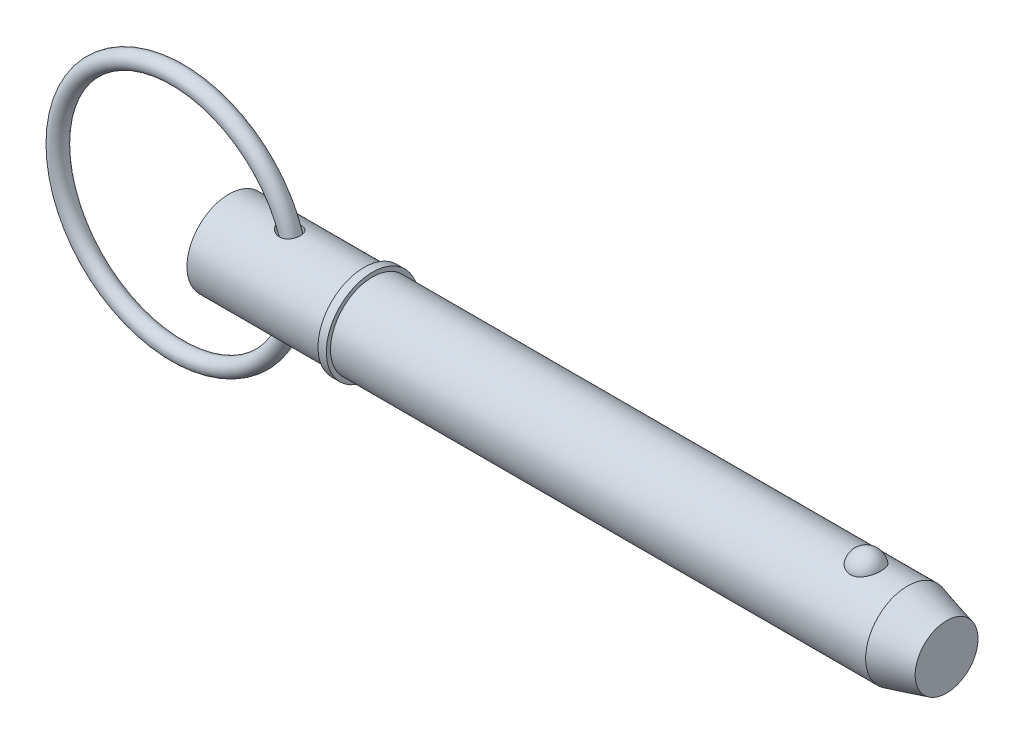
ISO-10303-21;
HEADER;
FILE_DESCRIPTION(('STEP AP214'),'2;1');
FILE_NAME('part.step','',(''),(''),'','','');
FILE_SCHEMA(('AUTOMOTIVE_DESIGN { 1 0 10303 214 1 1 1 1 }'));
ENDSEC;
DATA;
#1=APPLICATION_CONTEXT('core data for automotive mechanical design processes');
#2=APPLICATION_PROTOCOL_DEFINITION('international standard','automotive_design',2000,#1);
#3=PRODUCT_CONTEXT('',#1,'mechanical');
#4=PRODUCT('Part','Part','',(#3));
#5=PRODUCT_RELATED_PRODUCT_CATEGORY('part','',(#4));
#6=PRODUCT_DEFINITION_FORMATION('','',#4);
#7=PRODUCT_DEFINITION_CONTEXT('part definition',#1,'design');
#8=PRODUCT_DEFINITION('design','',#6,#7);
#9=PRODUCT_DEFINITION_SHAPE('','',#8);
#10=(LENGTH_UNIT() NAMED_UNIT(*) SI_UNIT(.MILLI.,.METRE.));
#11=(NAMED_UNIT(*) PLANE_ANGLE_UNIT() SI_UNIT($,.RADIAN.));
#12=(NAMED_UNIT(*) SI_UNIT($,.STERADIAN.) SOLID_ANGLE_UNIT());
#13=UNCERTAINTY_MEASURE_WITH_UNIT(LENGTH_MEASURE(1.E-05),#10,'distance_accuracy_value','');
#14=(GEOMETRIC_REPRESENTATION_CONTEXT(3) GLOBAL_UNCERTAINTY_ASSIGNED_CONTEXT((#13)) GLOBAL_UNIT_ASSIGNED_CONTEXT((#10,
#11,#12)) REPRESENTATION_CONTEXT('',''));
#15=CARTESIAN_POINT('',(0.,0.,0.));
#16=DIRECTION('',(0.,0.,1.));
#17=DIRECTION('',(1.,0.,0.));
#18=AXIS2_PLACEMENT_3D('',#15,#16,#17);
#19=CARTESIAN_POINT('',(-13.640845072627,0.,0.));
#20=DIRECTION('',(0.,0.,1.));
#21=DIRECTION('',(1.,0.,0.));
#22=AXIS2_PLACEMENT_3D('',#19,#20,#21);
#23=TOROIDAL_SURFACE('',#22,31.75,2.223);
#24=CARTESIAN_POINT('',(20.332154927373,0.,0.));
#25=VERTEX_POINT('',#24);
#26=VERTEX_LOOP('',#25);
#27=FACE_BOUND('',#26,.T.);
#28=ADVANCED_FACE('P0_F12',(#27),#23,.T.);
#29=CLOSED_SHELL('',(#28));
#30=MANIFOLD_SOLID_BREP('P0_B1',#29);
#31=CARTESIAN_POINT('',(0.,0.,0.));
#32=DIRECTION('',(1.,0.,0.));
#33=DIRECTION('',(0.,0.,-1.));
#34=AXIS2_PLACEMENT_3D('',#31,#32,#33);
#35=CYLINDRICAL_SURFACE('',#34,11.115);
#36=CARTESIAN_POINT('',(13.5245830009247,11.0328953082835,-1.34849772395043));
#37=CARTESIAN_POINT('',(13.6190616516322,11.0150940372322,-1.49413162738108));
#38=CARTESIAN_POINT('',(13.7272589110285,10.9954577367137,-1.63076546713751));
#39=CARTESIAN_POINT('',(13.9654537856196,10.9550099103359,-1.8834727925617));
#40=CARTESIAN_POINT('',(14.0954990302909,10.9341958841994,-1.99950019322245));
#41=CARTESIAN_POINT('',(14.3718600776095,10.893854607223,-2.20871939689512));
#42=CARTESIAN_POINT('',(14.5180879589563,10.8743212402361,-2.30202655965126));
#43=CARTESIAN_POINT('',(14.8233821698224,10.8385071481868,-2.46515115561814));
#44=CARTESIAN_POINT('',(14.9824448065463,10.8222254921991,-2.53497531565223));
#45=CARTESIAN_POINT('',(15.3233581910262,10.7936101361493,-2.65430007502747));
#46=CARTESIAN_POINT('',(15.5060064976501,10.7817126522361,-2.7016502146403));
#47=CARTESIAN_POINT('',(15.8771124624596,10.7657570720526,-2.76455948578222));
#48=CARTESIAN_POINT('',(16.0655695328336,10.7616981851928,-2.78012182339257));
#49=CARTESIAN_POINT('',(16.4345152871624,10.7624400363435,-2.77724928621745));
#50=CARTESIAN_POINT('',(16.6150121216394,10.7668823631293,-2.76018977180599));
#51=CARTESIAN_POINT('',(16.9695132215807,10.7837407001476,-2.69357457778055));
#52=CARTESIAN_POINT('',(17.1435222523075,10.7961507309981,-2.64404326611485));
#53=CARTESIAN_POINT('',(17.4621418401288,10.8258984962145,-2.51928348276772));
#54=CARTESIAN_POINT('',(17.6079677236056,10.8426430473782,-2.44700611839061));
#55=CARTESIAN_POINT('',(17.884162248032,10.8794194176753,-2.27791740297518));
#56=CARTESIAN_POINT('',(18.0145349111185,10.8994503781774,-2.18111245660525));
#57=CARTESIAN_POINT('',(18.2494965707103,10.9392822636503,-1.9713196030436));
#58=CARTESIAN_POINT('',(18.3550661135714,10.9590421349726,-1.85941863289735));
#59=CARTESIAN_POINT('',(18.5458147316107,10.9970986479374,-1.61919918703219));
#60=CARTESIAN_POINT('',(18.6309947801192,11.0153953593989,-1.49088149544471));
#61=CARTESIAN_POINT('',(18.7786686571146,11.0484675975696,-1.2218388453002));
#62=CARTESIAN_POINT('',(18.8412214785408,11.063252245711,-1.08114735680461));
#63=CARTESIAN_POINT('',(18.9425265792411,11.0877718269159,-0.791025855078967));
#64=CARTESIAN_POINT('',(18.9812780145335,11.0975065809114,-0.641595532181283));
#65=CARTESIAN_POINT('',(19.0343305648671,11.1109435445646,-0.336997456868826));
#66=CARTESIAN_POINT('',(19.0484404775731,11.1145985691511,-0.181794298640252));
#67=CARTESIAN_POINT('',(19.0513147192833,11.1153384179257,0.128864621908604));
#68=CARTESIAN_POINT('',(19.0400783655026,11.112423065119,0.284320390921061));
#69=CARTESIAN_POINT('',(18.9924362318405,11.1003163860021,0.591525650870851));
#70=CARTESIAN_POINT('',(18.9559600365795,11.0911075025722,0.743263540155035));
#71=CARTESIAN_POINT('',(18.858576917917,11.0673920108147,1.0382524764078));
#72=CARTESIAN_POINT('',(18.7976699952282,11.0528854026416,1.18150352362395));
#73=CARTESIAN_POINT('',(18.6529960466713,11.020201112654,1.45511394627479));
#74=CARTESIAN_POINT('',(18.5692772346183,11.0020311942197,1.58549973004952));
#75=CARTESIAN_POINT('',(18.3810003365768,10.9640237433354,1.82995492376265));
#76=CARTESIAN_POINT('',(18.2764441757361,10.9441863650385,1.94402583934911));
#77=CARTESIAN_POINT('',(18.0501398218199,10.9052267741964,2.15183128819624));
#78=CARTESIAN_POINT('',(17.9285270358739,10.8861003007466,2.24571250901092));
#79=CARTESIAN_POINT('',(17.6709592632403,10.8505244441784,2.41175942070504));
#80=CARTESIAN_POINT('',(17.5350055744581,10.8340748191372,2.48392707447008));
#81=CARTESIAN_POINT('',(17.2528390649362,10.8056099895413,2.60497667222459));
#82=CARTESIAN_POINT('',(17.1066353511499,10.7935909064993,2.65387899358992));
#83=CARTESIAN_POINT('',(16.8080326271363,10.7750969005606,2.72799859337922));
#84=CARTESIAN_POINT('',(16.6556326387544,10.7686228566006,2.75321211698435));
#85=CARTESIAN_POINT('',(16.3428877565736,10.761517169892,2.78086153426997));
#86=CARTESIAN_POINT('',(16.1824599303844,10.7611149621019,2.78240297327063));
#87=CARTESIAN_POINT('',(15.863296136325,10.766478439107,2.76156874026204));
#88=CARTESIAN_POINT('',(15.7045607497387,10.7722461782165,2.73918510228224));
#89=CARTESIAN_POINT('',(15.3787211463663,10.7898500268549,2.66904167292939));
#90=CARTESIAN_POINT('',(15.2120794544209,10.8021675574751,2.61925575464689));
#91=CARTESIAN_POINT('',(14.8886284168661,10.8315482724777,2.49496357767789));
#92=CARTESIAN_POINT('',(14.731827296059,10.8486153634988,2.42043695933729));
#93=CARTESIAN_POINT('',(14.4198762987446,10.8870804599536,2.24137362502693));
#94=CARTESIAN_POINT('',(14.2658484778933,10.9087148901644,2.13492229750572));
#95=CARTESIAN_POINT('',(13.9788214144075,10.9526299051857,1.89676517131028));
#96=CARTESIAN_POINT('',(13.8458041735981,10.9749099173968,1.76508120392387));
#97=CARTESIAN_POINT('',(13.6310853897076,11.012885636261,1.50762337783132));
#98=CARTESIAN_POINT('',(13.5444453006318,11.0290026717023,1.38602082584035));
#99=CARTESIAN_POINT('',(13.392158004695,11.0581740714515,1.12983363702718));
#100=CARTESIAN_POINT('',(13.3264946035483,11.0712307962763,0.995259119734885));
#101=CARTESIAN_POINT('',(13.2464179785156,11.0874250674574,0.785640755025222));
#102=CARTESIAN_POINT('',(13.2227369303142,11.0922707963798,0.714166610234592));
#103=CARTESIAN_POINT('',(13.1820656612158,11.1006486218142,0.569277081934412));
#104=CARTESIAN_POINT('',(13.1650721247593,11.1041813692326,0.495862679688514));
#105=CARTESIAN_POINT('',(13.1381118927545,11.1098070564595,0.347711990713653));
#106=CARTESIAN_POINT('',(13.1281436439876,11.1119003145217,0.272975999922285));
#107=CARTESIAN_POINT('',(13.1154243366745,11.1145746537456,0.122890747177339));
#108=CARTESIAN_POINT('',(13.1126723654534,11.1151559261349,0.0475415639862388));
#109=CARTESIAN_POINT('',(13.115160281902,11.1146296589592,-0.160384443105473));
#110=CARTESIAN_POINT('',(13.128061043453,11.111903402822,-0.292944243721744));
#111=CARTESIAN_POINT('',(13.175691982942,11.1019662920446,-0.553751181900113));
#112=CARTESIAN_POINT('',(13.2104121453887,11.094757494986,-0.682000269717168));
#113=CARTESIAN_POINT('',(13.2891255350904,11.0787645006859,-0.901873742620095));
#114=CARTESIAN_POINT('',(13.3290466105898,11.0707438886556,-0.995044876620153));
#115=CARTESIAN_POINT('',(13.4192915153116,11.0529876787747,-1.17599209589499));
#116=CARTESIAN_POINT('',(13.4696154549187,11.0432520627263,-1.26376812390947));
#117=CARTESIAN_POINT('',(13.5245830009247,11.0328953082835,-1.34849772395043));
#118=B_SPLINE_CURVE_WITH_KNOTS('',3,(#36,#37,#38,#39,#40,#41,#42,#43,#44,#45,#46,#47,#48,#49,
#50,#51,#52,#53,#54,#55,#56,#57,#58,#59,#60,#61,#62,#63,#64,#65,#66,#67,#68,#69,#70,#71,#72,#73,
#74,#75,#76,#77,#78,#79,#80,#81,#82,#83,#84,#85,#86,#87,#88,#89,#90,#91,#92,#93,#94,#95,#96,#97,
#98,#99,#100,#101,#102,#103,#104,#105,#106,#107,#108,#109,#110,#111,#112,#113,#114,#115,#116,
#117),.UNSPECIFIED.,.T.,.F.,(4,2,2,2,2,2,2,2,2,2,2,2,2,2,2,2,2,2,2,2,2,2,2,2,2,2,2,2,2,2,2,2,2,
2,2,2,2,2,2,2,4),(0.,0.52309976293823,1.04735506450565,1.56889024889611,2.09027590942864,
2.65465173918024,3.21897064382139,3.76002078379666,4.30066536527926,4.78898318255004,
5.27717362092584,5.74028268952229,6.20336964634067,6.665240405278,7.12712754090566,
7.59258295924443,8.05805091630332,8.52482272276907,8.99159451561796,9.45738731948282,
9.9231371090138,10.3853792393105,10.8475795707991,11.3093743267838,11.7712422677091,
12.2505208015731,12.7299589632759,13.2508366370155,13.7721440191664,14.334890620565,
14.8971525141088,15.3459336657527,15.7943675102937,16.0204422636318,16.2464047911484,
16.4723173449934,16.6982013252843,17.095711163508,17.4930386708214,17.7973741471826,
18.1017128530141),.UNSPECIFIED.);
#119=CARTESIAN_POINT('',(13.5245830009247,11.0328953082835,-1.34849772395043));
#120=VERTEX_POINT('',#119);
#121=EDGE_CURVE('P1_E42',#120,#120,#118,.T.);
#122=ORIENTED_EDGE('',*,*,#121,.T.);
#123=EDGE_LOOP('',(#122));
#124=FACE_BOUND('',#123,.T.);
#125=CARTESIAN_POINT('',(0.,0.,0.));
#126=DIRECTION('',(1.,0.,0.));
#127=DIRECTION('',(0.,0.,-1.));
#128=AXIS2_PLACEMENT_3D('',#125,#126,#127);
#129=CIRCLE('',#128,11.115);
#130=CARTESIAN_POINT('',(0.,0.,-11.115));
#131=VERTEX_POINT('',#130);
#132=EDGE_CURVE('P1_E9',#131,#131,#129,.T.);
#133=ORIENTED_EDGE('',*,*,#132,.T.);
#134=EDGE_LOOP('',(#133));
#135=FACE_BOUND('',#134,.T.);
#136=CARTESIAN_POINT('',(35.877,0.,0.));
#137=DIRECTION('',(1.,0.,0.));
#138=DIRECTION('',(0.,0.,-1.));
#139=AXIS2_PLACEMENT_3D('',#136,#137,#138);
#140=CIRCLE('',#139,11.115);
#141=CARTESIAN_POINT('',(35.877,0.,-11.115));
#142=VERTEX_POINT('',#141);
#143=EDGE_CURVE('P1_E25',#142,#142,#140,.T.);
#144=ORIENTED_EDGE('',*,*,#143,.F.);
#145=EDGE_LOOP('',(#144));
#146=FACE_BOUND('',#145,.T.);
#147=CARTESIAN_POINT('',(13.5245830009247,-11.0328953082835,-1.34849772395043));
#148=CARTESIAN_POINT('',(13.449887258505,-11.0469690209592,-1.233356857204));
#149=CARTESIAN_POINT('',(13.3837464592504,-11.0598986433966,-1.11255897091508));
#150=CARTESIAN_POINT('',(13.271526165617,-11.0822620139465,-0.861680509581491));
#151=CARTESIAN_POINT('',(13.2254273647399,-11.0916991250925,-0.731609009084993));
#152=CARTESIAN_POINT('',(13.1557497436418,-11.1060943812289,-0.464578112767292));
#153=CARTESIAN_POINT('',(13.1322820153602,-11.111030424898,-0.327588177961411));
#154=CARTESIAN_POINT('',(13.1098958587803,-11.1157368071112,-0.0515139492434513));
#155=CARTESIAN_POINT('',(13.1109730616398,-11.1155080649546,0.0875699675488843));
#156=CARTESIAN_POINT('',(13.1367722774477,-11.110088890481,0.354927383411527));
#157=CARTESIAN_POINT('',(13.160070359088,-11.1051972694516,0.483348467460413));
#158=CARTESIAN_POINT('',(13.2268311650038,-11.091413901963,0.734581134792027));
#159=CARTESIAN_POINT('',(13.2702981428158,-11.0825213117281,0.857391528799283));
#160=CARTESIAN_POINT('',(13.3769008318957,-11.0612491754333,1.09871322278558));
#161=CARTESIAN_POINT('',(13.4406446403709,-11.048763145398,1.21694419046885));
#162=CARTESIAN_POINT('',(13.5844860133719,-11.0215642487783,1.44267020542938));
#163=CARTESIAN_POINT('',(13.6645903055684,-11.0068504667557,1.55016080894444));
#164=CARTESIAN_POINT('',(13.8511803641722,-10.9741237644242,1.76795565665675));
#165=CARTESIAN_POINT('',(13.959808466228,-10.9559422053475,1.87639683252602));
#166=CARTESIAN_POINT('',(14.1916437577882,-10.9197998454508,2.07642617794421));
#167=CARTESIAN_POINT('',(14.3148607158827,-10.901839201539,2.16800294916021));
#168=CARTESIAN_POINT('',(14.5931107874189,-10.8649902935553,2.34622033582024));
#169=CARTESIAN_POINT('',(14.7501095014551,-10.8463937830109,2.42986679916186));
#170=CARTESIAN_POINT('',(15.0757118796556,-10.8136392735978,2.57171975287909));
#171=CARTESIAN_POINT('',(15.2443214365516,-10.7994835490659,2.62991321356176));
#172=CARTESIAN_POINT('',(15.599068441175,-10.7767894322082,2.72147498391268));
#173=CARTESIAN_POINT('',(15.7856559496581,-10.768622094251,2.75321798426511));
#174=CARTESIAN_POINT('',(16.1617095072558,-10.7608206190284,2.78356776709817));
#175=CARTESIAN_POINT('',(16.3511739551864,-10.7611818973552,2.78219235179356));
#176=CARTESIAN_POINT('',(16.7138126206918,-10.7705428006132,2.7457129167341));
#177=CARTESIAN_POINT('',(16.8872269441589,-10.7789612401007,2.71287798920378));
#178=CARTESIAN_POINT('',(17.2247245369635,-10.8028011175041,2.61632772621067));
#179=CARTESIAN_POINT('',(17.3888134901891,-10.8182182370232,2.55263143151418));
#180=CARTESIAN_POINT('',(17.6871641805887,-10.8524191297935,2.40281428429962));
#181=CARTESIAN_POINT('',(17.8227812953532,-10.8707652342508,2.31928155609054));
#182=CARTESIAN_POINT('',(18.0770765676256,-10.9094513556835,2.12988301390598));
#183=CARTESIAN_POINT('',(18.1957578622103,-10.9297910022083,2.0240213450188));
#184=CARTESIAN_POINT('',(18.4088055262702,-10.9693230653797,1.79719870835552));
#185=CARTESIAN_POINT('',(18.5038890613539,-10.9885305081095,1.67691225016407));
#186=CARTESIAN_POINT('',(18.6726701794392,-11.0244347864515,1.42183894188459));
#187=CARTESIAN_POINT('',(18.7463681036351,-11.0411316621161,1.28705232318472));
#188=CARTESIAN_POINT('',(18.8708297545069,-11.0702507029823,1.00634471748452));
#189=CARTESIAN_POINT('',(18.9215212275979,-11.0826593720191,0.860390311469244));
#190=CARTESIAN_POINT('',(18.9984973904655,-11.1017993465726,0.561823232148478));
#191=CARTESIAN_POINT('',(19.0247811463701,-11.1085304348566,0.409210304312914));
#192=CARTESIAN_POINT('',(19.0524622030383,-11.1156244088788,0.100537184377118));
#193=CARTESIAN_POINT('',(19.0536873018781,-11.1159432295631,-0.0555394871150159));
#194=CARTESIAN_POINT('',(19.0307837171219,-11.110065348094,-0.365700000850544));
#195=CARTESIAN_POINT('',(19.0066544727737,-11.1038685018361,-0.519783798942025));
#196=CARTESIAN_POINT('',(18.9335163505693,-11.0856111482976,-0.821817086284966));
#197=CARTESIAN_POINT('',(18.88447016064,-11.0735418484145,-0.969757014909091));
#198=CARTESIAN_POINT('',(18.7625929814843,-11.0448501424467,-1.25502066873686));
#199=CARTESIAN_POINT('',(18.6897623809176,-11.0282278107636,-1.39234456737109));
#200=CARTESIAN_POINT('',(18.522359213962,-10.9923333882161,-1.65195905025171));
#201=CARTESIAN_POINT('',(18.427863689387,-10.9730707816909,-1.77430060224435));
#202=CARTESIAN_POINT('',(18.2194216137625,-10.9340072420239,-2.00099176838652));
#203=CARTESIAN_POINT('',(18.1054772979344,-10.9142063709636,-2.10534344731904));
#204=CARTESIAN_POINT('',(17.8622613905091,-10.8764452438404,-2.2924289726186));
#205=CARTESIAN_POINT('',(17.7331196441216,-10.8584715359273,-2.3753290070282));
#206=CARTESIAN_POINT('',(17.4625069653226,-10.8261386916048,-2.51860389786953));
#207=CARTESIAN_POINT('',(17.3210365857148,-10.8117793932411,-2.57897976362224));
#208=CARTESIAN_POINT('',(17.0290309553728,-10.7880576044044,-2.67648805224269));
#209=CARTESIAN_POINT('',(16.8784484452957,-10.7787241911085,-2.71348542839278));
#210=CARTESIAN_POINT('',(16.573148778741,-10.7659618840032,-2.7636855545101));
#211=CARTESIAN_POINT('',(16.4184306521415,-10.7625343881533,-2.77688267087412));
#212=CARTESIAN_POINT('',(16.1008073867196,-10.761643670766,-2.78033419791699));
#213=CARTESIAN_POINT('',(15.9378898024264,-10.7644957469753,-2.76937572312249));
#214=CARTESIAN_POINT('',(15.6157286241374,-10.7762062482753,-2.72344300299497));
#215=CARTESIAN_POINT('',(15.4564861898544,-10.7850665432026,-2.68846128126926));
#216=CARTESIAN_POINT('',(15.1305734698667,-10.808737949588,-2.59174021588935));
#217=CARTESIAN_POINT('',(14.9645834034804,-10.8240246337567,-2.52782071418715));
#218=CARTESIAN_POINT('',(14.6448218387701,-10.8585969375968,-2.37491543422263));
#219=CARTESIAN_POINT('',(14.4910653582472,-10.8778873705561,-2.28589943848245));
#220=CARTESIAN_POINT('',(14.1837929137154,-10.920550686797,-2.07312951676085));
#221=CARTESIAN_POINT('',(14.0321999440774,-10.9441390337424,-1.94661563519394));
#222=CARTESIAN_POINT('',(13.756115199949,-10.9902311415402,-1.66673537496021));
#223=CARTESIAN_POINT('',(13.6315733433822,-11.0127368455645,-1.51341958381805));
#224=CARTESIAN_POINT('',(13.5245830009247,-11.0328953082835,-1.34849772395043));
#225=B_SPLINE_CURVE_WITH_KNOTS('',3,(#147,#148,#149,#150,#151,#152,#153,#154,#155,#156,#157,
#158,#159,#160,#161,#162,#163,#164,#165,#166,#167,#168,#169,#170,#171,#172,#173,#174,#175,#176,
#177,#178,#179,#180,#181,#182,#183,#184,#185,#186,#187,#188,#189,#190,#191,#192,#193,#194,#195,
#196,#197,#198,#199,#200,#201,#202,#203,#204,#205,#206,#207,#208,#209,#210,#211,#212,#213,#214,
#215,#216,#217,#218,#219,#220,#221,#222,#223,#224),.UNSPECIFIED.,.T.,.F.,(4,2,2,2,2,2,2,2,2,2,2,
2,2,2,2,2,2,2,2,2,2,2,2,2,2,2,2,2,2,2,2,2,2,2,2,2,2,2,4),(0.,0.4133945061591,0.8263899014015,
1.24140245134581,1.65634113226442,2.04635967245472,2.43646050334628,2.83958259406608,
3.24287078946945,3.70479277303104,4.16702582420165,4.70130512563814,5.23585761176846,
5.80123945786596,6.36631739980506,6.89348344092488,7.42032464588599,7.8989135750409,
8.37741373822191,8.83881993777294,9.30021877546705,9.76305681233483,10.2259125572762,
10.6919479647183,11.1579936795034,11.6247393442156,12.0914773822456,12.55658073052,
13.0216306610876,13.4829619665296,13.9442725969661,14.408224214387,14.8722856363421,
15.3601762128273,15.8482186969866,16.3815107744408,16.9154477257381,17.5086806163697,
18.1008056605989),.UNSPECIFIED.);
#226=CARTESIAN_POINT('',(13.5245830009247,-11.0328953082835,-1.34849772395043));
#227=VERTEX_POINT('',#226);
#228=EDGE_CURVE('P1_E17',#227,#227,#225,.T.);
#229=ORIENTED_EDGE('',*,*,#228,.T.);
#230=EDGE_LOOP('',(#229));
#231=FACE_BOUND('',#230,.T.);
#232=ADVANCED_FACE('P1_F13',(#124,#135,#146,#231),#35,.T.);
#233=CARTESIAN_POINT('',(0.,0.,0.));
#234=DIRECTION('',(1.,0.,0.));
#235=DIRECTION('',(0.,0.,-1.));
#236=AXIS2_PLACEMENT_3D('',#233,#234,#235);
#237=CYLINDRICAL_SURFACE('',#236,11.115);
#238=CARTESIAN_POINT('',(180.129563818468,0.,0.));
#239=DIRECTION('',(1.,0.,0.));
#240=DIRECTION('',(0.,0.,-1.));
#241=AXIS2_PLACEMENT_3D('',#238,#239,#240);
#242=CIRCLE('',#241,11.115);
#243=CARTESIAN_POINT('',(180.129563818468,0.,-11.115));
#244=VERTEX_POINT('',#243);
#245=EDGE_CURVE('P1_E99',#244,#244,#242,.T.);
#246=ORIENTED_EDGE('',*,*,#245,.F.);
#247=EDGE_LOOP('',(#246));
#248=FACE_BOUND('',#247,.T.);
#249=CARTESIAN_POINT('',(38.1,0.,0.));
#250=DIRECTION('',(1.,0.,0.));
#251=DIRECTION('',(0.,0.,-1.));
#252=AXIS2_PLACEMENT_3D('',#249,#250,#251);
#253=CIRCLE('',#252,11.115);
#254=CARTESIAN_POINT('',(38.1,0.,-11.115));
#255=VERTEX_POINT('',#254);
#256=EDGE_CURVE('P1_E96',#255,#255,#253,.T.);
#257=ORIENTED_EDGE('',*,*,#256,.T.);
#258=EDGE_LOOP('',(#257));
#259=FACE_BOUND('',#258,.T.);
#260=CARTESIAN_POINT('',(169.131068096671,10.3028087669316,4.17077409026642));
#261=CARTESIAN_POINT('',(168.914775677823,10.3028003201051,4.17078240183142));
#262=CARTESIAN_POINT('',(168.698548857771,10.3098895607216,4.1534059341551));
#263=CARTESIAN_POINT('',(168.272540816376,10.3373834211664,4.08449540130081));
#264=CARTESIAN_POINT('',(168.062757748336,10.3577841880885,4.03297121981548));
#265=CARTESIAN_POINT('',(167.655782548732,10.4095237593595,3.89746513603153));
#266=CARTESIAN_POINT('',(167.458572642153,10.4408466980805,3.81353029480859));
#267=CARTESIAN_POINT('',(167.081338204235,10.5110236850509,3.61560339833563));
#268=CARTESIAN_POINT('',(166.901317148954,10.5498792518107,3.50160528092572));
#269=CARTESIAN_POINT('',(166.557684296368,10.6322884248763,3.2429246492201));
#270=CARTESIAN_POINT('',(166.394686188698,10.6759443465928,3.09746040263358));
#271=CARTESIAN_POINT('',(166.094591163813,10.7625291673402,2.78171925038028));
#272=CARTESIAN_POINT('',(165.957499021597,10.8054579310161,2.61143778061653));
#273=CARTESIAN_POINT('',(165.706408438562,10.8881935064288,2.24226695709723));
#274=CARTESIAN_POINT('',(165.593710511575,10.9277761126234,2.04244123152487));
#275=CARTESIAN_POINT('',(165.401777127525,10.997484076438,1.62578254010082));
#276=CARTESIAN_POINT('',(165.322544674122,11.0276085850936,1.40894804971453));
#277=CARTESIAN_POINT('',(165.198303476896,11.0756732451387,0.961250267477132));
#278=CARTESIAN_POINT('',(165.153760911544,11.0934470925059,0.730239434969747));
#279=CARTESIAN_POINT('',(165.101569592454,11.1143331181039,0.263439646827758));
#280=CARTESIAN_POINT('',(165.093920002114,11.1174456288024,0.0276507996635));
#281=CARTESIAN_POINT('',(165.11561056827,11.1087161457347,-0.440729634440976));
#282=CARTESIAN_POINT('',(165.144762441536,11.0969502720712,-0.673331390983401));
#283=CARTESIAN_POINT('',(165.239143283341,11.0597872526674,-1.12996621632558));
#284=CARTESIAN_POINT('',(165.304372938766,11.0343898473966,-1.35399912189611));
#285=CARTESIAN_POINT('',(165.46969844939,10.972515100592,-1.78750286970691));
#286=CARTESIAN_POINT('',(165.56983863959,10.9360236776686,-1.99695478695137));
#287=CARTESIAN_POINT('',(165.802940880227,10.855759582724,-2.39520667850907));
#288=CARTESIAN_POINT('',(165.935905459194,10.8119863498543,-2.58400506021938));
#289=CARTESIAN_POINT('',(166.232407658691,10.7216733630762,-2.93635726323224));
#290=CARTESIAN_POINT('',(166.396056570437,10.675123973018,-3.09981510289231));
#291=CARTESIAN_POINT('',(166.749860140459,10.5846571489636,-3.3959224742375));
#292=CARTESIAN_POINT('',(166.940012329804,10.5407394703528,-3.52857487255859));
#293=CARTESIAN_POINT('',(167.33750141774,10.4616690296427,-3.7564605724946));
#294=CARTESIAN_POINT('',(167.54436705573,10.4263443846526,-3.85245432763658));
#295=CARTESIAN_POINT('',(167.972954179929,10.3675574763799,-4.00798747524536));
#296=CARTESIAN_POINT('',(168.194670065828,10.344090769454,-4.06754052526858));
#297=CARTESIAN_POINT('',(168.634669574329,10.3128282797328,-4.14614314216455));
#298=CARTESIAN_POINT('',(168.852565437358,10.3043040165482,-4.16707833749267));
#299=CARTESIAN_POINT('',(169.28894951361,10.3016771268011,-4.17357158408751));
#300=CARTESIAN_POINT('',(169.507437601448,10.3075716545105,-4.159136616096));
#301=CARTESIAN_POINT('',(169.931744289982,10.3326686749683,-4.0963696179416));
#302=CARTESIAN_POINT('',(170.137745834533,10.3514555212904,-4.04909574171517));
#303=CARTESIAN_POINT('',(170.538576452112,10.399818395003,-3.92320197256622));
#304=CARTESIAN_POINT('',(170.7334046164,10.4293952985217,-3.84457953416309));
#305=CARTESIAN_POINT('',(171.111191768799,10.4969600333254,-3.65612410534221));
#306=CARTESIAN_POINT('',(171.293797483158,10.5351178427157,-3.54564545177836));
#307=CARTESIAN_POINT('',(171.638204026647,10.6154999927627,-3.29718036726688));
#308=CARTESIAN_POINT('',(171.800000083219,10.657725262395,-3.15918764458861));
#309=CARTESIAN_POINT('',(172.106959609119,10.744212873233,-2.85163580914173));
#310=CARTESIAN_POINT('',(172.250891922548,10.7884718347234,-2.68084605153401));
#311=CARTESIAN_POINT('',(172.509237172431,10.872374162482,-2.3172186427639));
#312=CARTESIAN_POINT('',(172.623644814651,10.9120167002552,-2.12437704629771));
#313=CARTESIAN_POINT('',(172.823873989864,10.9838919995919,-1.71516999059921));
#314=CARTESIAN_POINT('',(172.90866178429,11.0158465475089,-1.498248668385));
#315=CARTESIAN_POINT('',(173.04268382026,11.0673523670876,-1.052285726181));
#316=CARTESIAN_POINT('',(173.091917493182,11.086903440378,-0.823243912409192));
#317=CARTESIAN_POINT('',(173.153891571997,11.1116323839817,-0.359087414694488));
#318=CARTESIAN_POINT('',(173.166566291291,11.1167843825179,-0.123962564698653));
#319=CARTESIAN_POINT('',(173.154973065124,11.1121144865,0.34522049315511));
#320=CARTESIAN_POINT('',(173.130705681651,11.1022928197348,0.579278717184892));
#321=CARTESIAN_POINT('',(173.045907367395,11.0687504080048,1.03866534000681));
#322=CARTESIAN_POINT('',(172.985529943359,11.0450885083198,1.26402641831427));
#323=CARTESIAN_POINT('',(172.829853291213,10.9863185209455,1.70076772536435));
#324=CARTESIAN_POINT('',(172.734551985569,10.9512097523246,1.91214712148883));
#325=CARTESIAN_POINT('',(172.510397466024,10.8729733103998,2.31608359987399));
#326=CARTESIAN_POINT('',(172.381380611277,10.8298068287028,2.50854240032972));
#327=CARTESIAN_POINT('',(172.092732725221,10.7401896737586,2.86808766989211));
#328=CARTESIAN_POINT('',(171.933102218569,10.6937390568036,3.03517457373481));
#329=CARTESIAN_POINT('',(171.587534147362,10.6029321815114,3.33857581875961));
#330=CARTESIAN_POINT('',(171.401708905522,10.5585680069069,3.47501541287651));
#331=CARTESIAN_POINT('',(171.007875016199,10.4769321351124,3.71390897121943));
#332=CARTESIAN_POINT('',(170.799863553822,10.439661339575,3.81635861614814));
#333=CARTESIAN_POINT('',(170.354066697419,10.3749407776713,3.98910631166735));
#334=CARTESIAN_POINT('',(170.115234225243,10.3482457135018,4.05700929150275));
#335=CARTESIAN_POINT('',(169.627925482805,10.312188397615,4.14782844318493));
#336=CARTESIAN_POINT('',(169.379453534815,10.3028184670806,4.1707645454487));
#337=CARTESIAN_POINT('',(169.131068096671,10.3028087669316,4.17077409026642));
#338=B_SPLINE_CURVE_WITH_KNOTS('',3,(#260,#261,#262,#263,#264,#265,#266,#267,#268,#269,#270,
#271,#272,#273,#274,#275,#276,#277,#278,#279,#280,#281,#282,#283,#284,#285,#286,#287,#288,#289,
#290,#291,#292,#293,#294,#295,#296,#297,#298,#299,#300,#301,#302,#303,#304,#305,#306,#307,#308,
#309,#310,#311,#312,#313,#314,#315,#316,#317,#318,#319,#320,#321,#322,#323,#324,#325,#326,#327,
#328,#329,#330,#331,#332,#333,#334,#335,#336,#337),.UNSPECIFIED.,.T.,.F.,(4,2,2,2,2,2,2,2,2,2,2,
2,2,2,2,2,2,2,2,2,2,2,2,2,2,2,2,2,2,2,2,2,2,2,2,2,2,2,4),(0.,0.647966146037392,1.29574482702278,
1.9425864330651,2.58955857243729,3.25496465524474,3.9204932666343,4.6156636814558,
5.31089647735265,6.01531821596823,6.71972398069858,7.42054043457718,8.12137023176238,
8.82309331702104,9.52487047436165,10.2292439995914,10.9335519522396,11.6223330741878,
12.31085589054,12.96476640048,13.618547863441,14.2521847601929,14.8858731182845,
15.5334360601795,16.1811472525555,16.8611459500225,17.5412664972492,18.2431855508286,
18.9451158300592,19.6483065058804,20.3514864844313,21.0516982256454,21.7519516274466,
22.4556690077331,23.1593743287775,23.8601491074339,24.561012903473,25.3054529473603,
26.0495629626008),.UNSPECIFIED.);
#339=CARTESIAN_POINT('',(169.131068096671,10.3028087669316,4.17077409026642));
#340=VERTEX_POINT('',#339);
#341=EDGE_CURVE('P1_E34',#340,#340,#338,.T.);
#342=ORIENTED_EDGE('',*,*,#341,.T.);
#343=EDGE_LOOP('',(#342));
#344=FACE_BOUND('',#343,.T.);
#345=ADVANCED_FACE('P1_F46',(#248,#259,#344),#237,.T.);
#346=CARTESIAN_POINT('',(0.,0.,0.));
#347=DIRECTION('',(-1.,0.,0.));
#348=DIRECTION('',(0.,0.,1.));
#349=AXIS2_PLACEMENT_3D('',#346,#347,#348);
#350=PLANE('',#349);
#351=ORIENTED_EDGE('',*,*,#132,.F.);
#352=EDGE_LOOP('',(#351));
#353=FACE_BOUND('',#352,.T.);
#354=ADVANCED_FACE('P1_F15',(#353),#350,.T.);
#355=CARTESIAN_POINT('',(35.877,11.115,0.));
#356=DIRECTION('',(-1.,0.,0.));
#357=DIRECTION('',(0.,0.,1.));
#358=AXIS2_PLACEMENT_3D('',#355,#356,#357);
#359=PLANE('',#358);
#360=ORIENTED_EDGE('',*,*,#143,.T.);
#361=EDGE_LOOP('',(#360));
#362=FACE_BOUND('',#361,.T.);
#363=CARTESIAN_POINT('',(35.877,0.,0.));
#364=DIRECTION('',(1.,0.,0.));
#365=DIRECTION('',(0.,0.,-1.));
#366=AXIS2_PLACEMENT_3D('',#363,#364,#365);
#367=CIRCLE('',#366,12.2265);
#368=CARTESIAN_POINT('',(35.877,0.,-12.2265));
#369=VERTEX_POINT('',#368);
#370=EDGE_CURVE('P1_E30',#369,#369,#367,.T.);
#371=ORIENTED_EDGE('',*,*,#370,.F.);
#372=EDGE_LOOP('',(#371));
#373=FACE_BOUND('',#372,.T.);
#374=ADVANCED_FACE('P1_F81',(#362,#373),#359,.T.);
#375=CARTESIAN_POINT('',(0.,0.,0.));
#376=DIRECTION('',(1.,0.,0.));
#377=DIRECTION('',(0.,0.,-1.));
#378=AXIS2_PLACEMENT_3D('',#375,#376,#377);
#379=CYLINDRICAL_SURFACE('',#378,12.2265);
#380=ORIENTED_EDGE('',*,*,#370,.T.);
#381=EDGE_LOOP('',(#380));
#382=FACE_BOUND('',#381,.T.);
#383=CARTESIAN_POINT('',(38.1,0.,0.));
#384=DIRECTION('',(1.,0.,0.));
#385=DIRECTION('',(0.,0.,-1.));
#386=AXIS2_PLACEMENT_3D('',#383,#384,#385);
#387=CIRCLE('',#386,12.2265);
#388=CARTESIAN_POINT('',(38.1,0.,-12.2265));
#389=VERTEX_POINT('',#388);
#390=EDGE_CURVE('P1_E95',#389,#389,#387,.T.);
#391=ORIENTED_EDGE('',*,*,#390,.F.);
#392=EDGE_LOOP('',(#391));
#393=FACE_BOUND('',#392,.T.);
#394=ADVANCED_FACE('P1_F68',(#382,#393),#379,.T.);
#395=CARTESIAN_POINT('',(38.1,12.2265,0.));
#396=DIRECTION('',(1.,0.,0.));
#397=DIRECTION('',(0.,0.,-1.));
#398=AXIS2_PLACEMENT_3D('',#395,#396,#397);
#399=PLANE('',#398);
#400=ORIENTED_EDGE('',*,*,#390,.T.);
#401=EDGE_LOOP('',(#400));
#402=FACE_BOUND('',#401,.T.);
#403=ORIENTED_EDGE('',*,*,#256,.F.);
#404=EDGE_LOOP('',(#403));
#405=FACE_BOUND('',#404,.T.);
#406=ADVANCED_FACE('P1_F62',(#402,#405),#399,.T.);
#407=CARTESIAN_POINT('',(190.5,0.,0.));
#408=DIRECTION('',(-1.,0.,0.));
#409=DIRECTION('',(0.,0.,1.));
#410=AXIS2_PLACEMENT_3D('',#407,#408,#409);
#411=CONICAL_SURFACE('',#410,8.33625000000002,0.26179938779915);
#412=ORIENTED_EDGE('',*,*,#245,.T.);
#413=EDGE_LOOP('',(#412));
#414=FACE_BOUND('',#413,.T.);
#415=CARTESIAN_POINT('',(190.5,0.,0.));
#416=DIRECTION('',(1.,0.,0.));
#417=DIRECTION('',(0.,0.,-1.));
#418=AXIS2_PLACEMENT_3D('',#415,#416,#417);
#419=CIRCLE('',#418,8.33625000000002);
#420=CARTESIAN_POINT('',(190.5,0.,-8.33625000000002));
#421=VERTEX_POINT('',#420);
#422=EDGE_CURVE('P1_E41',#421,#421,#419,.T.);
#423=ORIENTED_EDGE('',*,*,#422,.F.);
#424=EDGE_LOOP('',(#423));
#425=FACE_BOUND('',#424,.T.);
#426=ADVANCED_FACE('P1_F59',(#414,#425),#411,.T.);
#427=CARTESIAN_POINT('',(190.5,8.33625000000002,0.));
#428=DIRECTION('',(1.,0.,0.));
#429=DIRECTION('',(0.,0.,-1.));
#430=AXIS2_PLACEMENT_3D('',#427,#428,#429);
#431=PLANE('',#430);
#432=ORIENTED_EDGE('',*,*,#422,.T.);
#433=EDGE_LOOP('',(#432));
#434=FACE_BOUND('',#433,.T.);
#435=ADVANCED_FACE('P1_F55',(#434),#431,.T.);
#436=CARTESIAN_POINT('',(169.131068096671,10.0035,0.));
#437=DIRECTION('',(-1.,0.,0.));
#438=DIRECTION('',(0.,1.,0.));
#439=AXIS2_PLACEMENT_3D('',#436,#437,#438);
#440=SPHERICAL_SURFACE('',#439,4.18149999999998);
#441=ORIENTED_EDGE('',*,*,#341,.F.);
#442=EDGE_LOOP('',(#441));
#443=FACE_BOUND('',#442,.T.);
#444=ADVANCED_FACE('P1_F50',(#443),#440,.T.);
#445=CARTESIAN_POINT('',(-13.640845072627,0.,0.));
#446=DIRECTION('',(0.,0.,1.));
#447=DIRECTION('',(1.,0.,0.));
#448=AXIS2_PLACEMENT_3D('',#445,#446,#447);
#449=TOROIDAL_SURFACE('',#448,31.75,2.77875);
#450=ORIENTED_EDGE('',*,*,#228,.F.);
#451=EDGE_LOOP('',(#450));
#452=FACE_BOUND('',#451,.T.);
#453=ORIENTED_EDGE('',*,*,#121,.F.);
#454=EDGE_LOOP('',(#453));
#455=FACE_BOUND('',#454,.T.);
#456=ADVANCED_FACE('P1_F54',(#452,#455),#449,.F.);
#457=CLOSED_SHELL('',(#232,#345,#354,#374,#394,#406,#426,#435,#444,#456));
#458=MANIFOLD_SOLID_BREP('P1_B1',#457);
#459=ADVANCED_BREP_SHAPE_REPRESENTATION('',(#18,#30,#458),#14);
#460=SHAPE_DEFINITION_REPRESENTATION(#9,#459);
ENDSEC;
END-ISO-10303-21;
